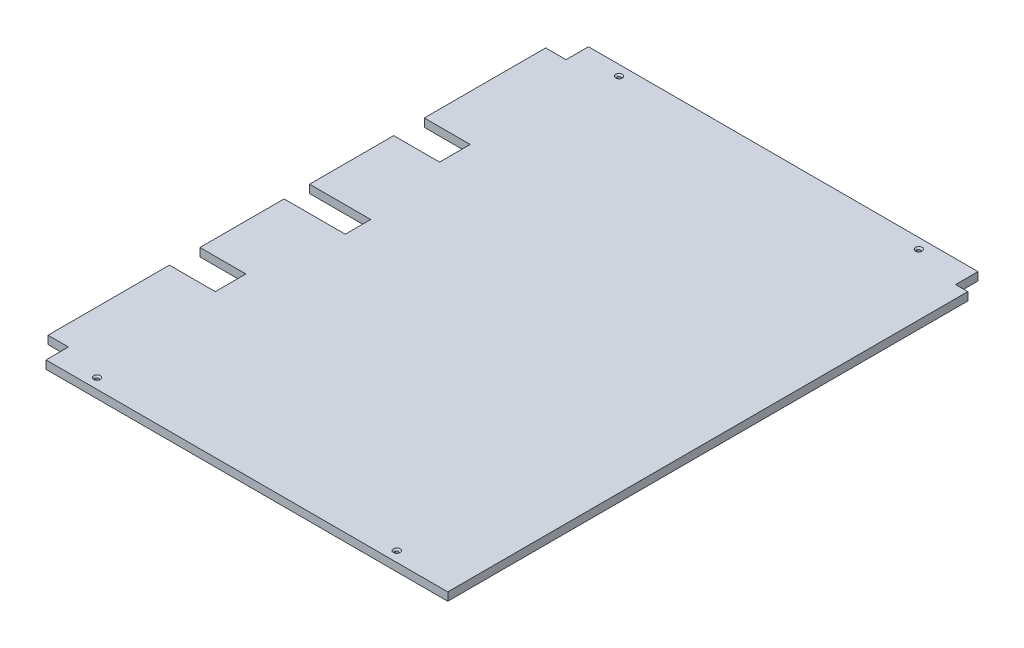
ISO-10303-21;
HEADER;
FILE_DESCRIPTION(('STEP AP214'),'2;1');
FILE_NAME('part.step','',(''),(''),'','','');
FILE_SCHEMA(('AUTOMOTIVE_DESIGN { 1 0 10303 214 1 1 1 1 }'));
ENDSEC;
DATA;
#1=APPLICATION_CONTEXT('core data for automotive mechanical design processes');
#2=APPLICATION_PROTOCOL_DEFINITION('international standard','automotive_design',2000,#1);
#3=PRODUCT_CONTEXT('',#1,'mechanical');
#4=PRODUCT('Part','Part','',(#3));
#5=PRODUCT_RELATED_PRODUCT_CATEGORY('part','',(#4));
#6=PRODUCT_DEFINITION_FORMATION('','',#4);
#7=PRODUCT_DEFINITION_CONTEXT('part definition',#1,'design');
#8=PRODUCT_DEFINITION('design','',#6,#7);
#9=PRODUCT_DEFINITION_SHAPE('','',#8);
#10=(LENGTH_UNIT() NAMED_UNIT(*) SI_UNIT(.MILLI.,.METRE.));
#11=(NAMED_UNIT(*) PLANE_ANGLE_UNIT() SI_UNIT($,.RADIAN.));
#12=(NAMED_UNIT(*) SI_UNIT($,.STERADIAN.) SOLID_ANGLE_UNIT());
#13=UNCERTAINTY_MEASURE_WITH_UNIT(LENGTH_MEASURE(1.E-05),#10,'distance_accuracy_value','');
#14=(GEOMETRIC_REPRESENTATION_CONTEXT(3) GLOBAL_UNCERTAINTY_ASSIGNED_CONTEXT((#13)) GLOBAL_UNIT_ASSIGNED_CONTEXT((#10,
#11,#12)) REPRESENTATION_CONTEXT('',''));
#15=CARTESIAN_POINT('',(0.,0.,0.));
#16=DIRECTION('',(0.,0.,1.));
#17=DIRECTION('',(1.,0.,0.));
#18=AXIS2_PLACEMENT_3D('',#15,#16,#17);
#19=CARTESIAN_POINT('',(-207.,8.,266.));
#20=DIRECTION('',(1.,0.,0.));
#21=DIRECTION('',(0.,0.,-1.));
#22=AXIS2_PLACEMENT_3D('',#19,#20,#21);
#23=PLANE('',#22);
#24=DIRECTION('',(0.,0.,1.));
#25=VECTOR('',#24,1.);
#26=CARTESIAN_POINT('',(-207.,0.,266.));
#27=LINE('',#26,#25);
#28=CARTESIAN_POINT('',(-207.,0.,-244.));
#29=VERTEX_POINT('',#28);
#30=CARTESIAN_POINT('',(-207.,0.,-125.));
#31=VERTEX_POINT('',#30);
#32=EDGE_CURVE('E220',#29,#31,#27,.T.);
#33=ORIENTED_EDGE('',*,*,#32,.T.);
#34=DIRECTION('',(0.,1.,0.));
#35=VECTOR('',#34,1.);
#36=CARTESIAN_POINT('',(-207.,0.,-125.));
#37=LINE('',#36,#35);
#38=CARTESIAN_POINT('',(-207.,8.,-125.));
#39=VERTEX_POINT('',#38);
#40=EDGE_CURVE('E371',#31,#39,#37,.T.);
#41=ORIENTED_EDGE('',*,*,#40,.T.);
#42=DIRECTION('',(0.,0.,1.));
#43=VECTOR('',#42,1.);
#44=CARTESIAN_POINT('',(-207.,8.,266.));
#45=LINE('',#44,#43);
#46=CARTESIAN_POINT('',(-207.,8.,-244.));
#47=VERTEX_POINT('',#46);
#48=EDGE_CURVE('E332',#47,#39,#45,.T.);
#49=ORIENTED_EDGE('',*,*,#48,.F.);
#50=DIRECTION('',(0.,1.,0.));
#51=VECTOR('',#50,1.);
#52=CARTESIAN_POINT('',(-207.,0.,-244.));
#53=LINE('',#52,#51);
#54=EDGE_CURVE('E475',#29,#47,#53,.T.);
#55=ORIENTED_EDGE('',*,*,#54,.F.);
#56=EDGE_LOOP('',(#33,#41,#49,#55));
#57=FACE_BOUND('',#56,.T.);
#58=ADVANCED_FACE('F40',(#57),#23,.F.);
#59=CARTESIAN_POINT('',(-207.,0.,12.5));
#60=VERTEX_POINT('',#59);
#61=CARTESIAN_POINT('',(-207.,0.,95.));
#62=VERTEX_POINT('',#61);
#63=EDGE_CURVE('E221',#60,#62,#27,.T.);
#64=ORIENTED_EDGE('',*,*,#63,.T.);
#65=DIRECTION('',(0.,1.,0.));
#66=VECTOR('',#65,1.);
#67=CARTESIAN_POINT('',(-207.,0.,95.));
#68=LINE('',#67,#66);
#69=CARTESIAN_POINT('',(-207.,8.,95.));
#70=VERTEX_POINT('',#69);
#71=EDGE_CURVE('E357',#62,#70,#68,.T.);
#72=ORIENTED_EDGE('',*,*,#71,.T.);
#73=CARTESIAN_POINT('',(-207.,8.,12.5));
#74=VERTEX_POINT('',#73);
#75=EDGE_CURVE('E329',#74,#70,#45,.T.);
#76=ORIENTED_EDGE('',*,*,#75,.F.);
#77=DIRECTION('',(0.,1.,0.));
#78=VECTOR('',#77,1.);
#79=CARTESIAN_POINT('',(-207.,0.,12.5));
#80=LINE('',#79,#78);
#81=EDGE_CURVE('E433',#60,#74,#80,.T.);
#82=ORIENTED_EDGE('',*,*,#81,.F.);
#83=EDGE_LOOP('',(#64,#72,#76,#82));
#84=FACE_BOUND('',#83,.T.);
#85=ADVANCED_FACE('F288',(#84),#23,.F.);
#86=CARTESIAN_POINT('',(-207.,8.,125.));
#87=VERTEX_POINT('',#86);
#88=CARTESIAN_POINT('',(-207.,8.,244.));
#89=VERTEX_POINT('',#88);
#90=EDGE_CURVE('E319',#87,#89,#45,.T.);
#91=ORIENTED_EDGE('',*,*,#90,.F.);
#92=DIRECTION('',(0.,1.,0.));
#93=VECTOR('',#92,1.);
#94=CARTESIAN_POINT('',(-207.,0.,125.));
#95=LINE('',#94,#93);
#96=CARTESIAN_POINT('',(-207.,0.,125.));
#97=VERTEX_POINT('',#96);
#98=EDGE_CURVE('E320',#97,#87,#95,.T.);
#99=ORIENTED_EDGE('',*,*,#98,.F.);
#100=CARTESIAN_POINT('',(-207.,0.,244.));
#101=VERTEX_POINT('',#100);
#102=EDGE_CURVE('E228',#97,#101,#27,.T.);
#103=ORIENTED_EDGE('',*,*,#102,.T.);
#104=DIRECTION('',(0.,1.,0.));
#105=VECTOR('',#104,1.);
#106=CARTESIAN_POINT('',(-207.,0.,244.));
#107=LINE('',#106,#105);
#108=EDGE_CURVE('E323',#101,#89,#107,.T.);
#109=ORIENTED_EDGE('',*,*,#108,.T.);
#110=EDGE_LOOP('',(#91,#99,#103,#109));
#111=FACE_BOUND('',#110,.T.);
#112=ADVANCED_FACE('F294',(#111),#23,.F.);
#113=CARTESIAN_POINT('',(207.,8.,266.));
#114=DIRECTION('',(-1.,0.,0.));
#115=DIRECTION('',(0.,0.,1.));
#116=AXIS2_PLACEMENT_3D('',#113,#114,#115);
#117=PLANE('',#116);
#118=DIRECTION('',(0.,0.,-1.));
#119=VECTOR('',#118,1.);
#120=CARTESIAN_POINT('',(207.,0.,266.));
#121=LINE('',#120,#119);
#122=CARTESIAN_POINT('',(207.,0.,266.));
#123=VERTEX_POINT('',#122);
#124=CARTESIAN_POINT('',(207.,0.,-244.));
#125=VERTEX_POINT('',#124);
#126=EDGE_CURVE('E460',#123,#125,#121,.T.);
#127=ORIENTED_EDGE('',*,*,#126,.T.);
#128=DIRECTION('',(0.,1.,0.));
#129=VECTOR('',#128,1.);
#130=CARTESIAN_POINT('',(207.,0.,-244.));
#131=LINE('',#130,#129);
#132=CARTESIAN_POINT('',(207.,8.,-244.));
#133=VERTEX_POINT('',#132);
#134=EDGE_CURVE('E480',#125,#133,#131,.T.);
#135=ORIENTED_EDGE('',*,*,#134,.T.);
#136=DIRECTION('',(0.,0.,-1.));
#137=VECTOR('',#136,1.);
#138=CARTESIAN_POINT('',(207.,8.,266.));
#139=LINE('',#138,#137);
#140=CARTESIAN_POINT('',(207.,8.,266.));
#141=VERTEX_POINT('',#140);
#142=EDGE_CURVE('E236',#141,#133,#139,.T.);
#143=ORIENTED_EDGE('',*,*,#142,.F.);
#144=DIRECTION('',(0.,-1.,0.));
#145=VECTOR('',#144,1.);
#146=CARTESIAN_POINT('',(207.,8.,266.));
#147=LINE('',#146,#145);
#148=EDGE_CURVE('E237',#141,#123,#147,.T.);
#149=ORIENTED_EDGE('',*,*,#148,.T.);
#150=EDGE_LOOP('',(#127,#135,#143,#149));
#151=FACE_BOUND('',#150,.T.);
#152=ADVANCED_FACE('F307',(#151),#117,.F.);
#153=CARTESIAN_POINT('',(-207.,8.,-266.));
#154=DIRECTION('',(0.,0.,1.));
#155=DIRECTION('',(1.,0.,0.));
#156=AXIS2_PLACEMENT_3D('',#153,#154,#155);
#157=PLANE('',#156);
#158=DIRECTION('',(-1.,0.,0.));
#159=VECTOR('',#158,1.);
#160=CARTESIAN_POINT('',(-207.,0.,-266.));
#161=LINE('',#160,#159);
#162=CARTESIAN_POINT('',(195.,0.,-266.));
#163=VERTEX_POINT('',#162);
#164=CARTESIAN_POINT('',(-187.,0.,-266.));
#165=VERTEX_POINT('',#164);
#166=EDGE_CURVE('E232',#163,#165,#161,.T.);
#167=ORIENTED_EDGE('',*,*,#166,.T.);
#168=DIRECTION('',(0.,1.,0.));
#169=VECTOR('',#168,1.);
#170=CARTESIAN_POINT('',(-187.,0.,-266.));
#171=LINE('',#170,#169);
#172=CARTESIAN_POINT('',(-187.,8.,-266.));
#173=VERTEX_POINT('',#172);
#174=EDGE_CURVE('E455',#165,#173,#171,.T.);
#175=ORIENTED_EDGE('',*,*,#174,.T.);
#176=DIRECTION('',(-1.,0.,0.));
#177=VECTOR('',#176,1.);
#178=CARTESIAN_POINT('',(-207.,8.,-266.));
#179=LINE('',#178,#177);
#180=CARTESIAN_POINT('',(195.,8.,-266.));
#181=VERTEX_POINT('',#180);
#182=EDGE_CURVE('E330',#181,#173,#179,.T.);
#183=ORIENTED_EDGE('',*,*,#182,.F.);
#184=DIRECTION('',(0.,1.,0.));
#185=VECTOR('',#184,1.);
#186=CARTESIAN_POINT('',(195.,0.,-266.));
#187=LINE('',#186,#185);
#188=EDGE_CURVE('E500',#163,#181,#187,.T.);
#189=ORIENTED_EDGE('',*,*,#188,.F.);
#190=EDGE_LOOP('',(#167,#175,#183,#189));
#191=FACE_BOUND('',#190,.T.);
#192=ADVANCED_FACE('F300',(#191),#157,.F.);
#193=CARTESIAN_POINT('',(-207.,8.,-95.));
#194=VERTEX_POINT('',#193);
#195=CARTESIAN_POINT('',(-207.,8.,-12.5));
#196=VERTEX_POINT('',#195);
#197=EDGE_CURVE('E209',#194,#196,#45,.T.);
#198=ORIENTED_EDGE('',*,*,#197,.F.);
#199=DIRECTION('',(0.,1.,0.));
#200=VECTOR('',#199,1.);
#201=CARTESIAN_POINT('',(-207.,0.,-95.));
#202=LINE('',#201,#200);
#203=CARTESIAN_POINT('',(-207.,0.,-95.));
#204=VERTEX_POINT('',#203);
#205=EDGE_CURVE('E194',#204,#194,#202,.T.);
#206=ORIENTED_EDGE('',*,*,#205,.F.);
#207=CARTESIAN_POINT('',(-207.,0.,-12.5));
#208=VERTEX_POINT('',#207);
#209=EDGE_CURVE('E207',#204,#208,#27,.T.);
#210=ORIENTED_EDGE('',*,*,#209,.T.);
#211=DIRECTION('',(0.,1.,0.));
#212=VECTOR('',#211,1.);
#213=CARTESIAN_POINT('',(-207.,0.,-12.5));
#214=LINE('',#213,#212);
#215=EDGE_CURVE('E436',#208,#196,#214,.T.);
#216=ORIENTED_EDGE('',*,*,#215,.T.);
#217=EDGE_LOOP('',(#198,#206,#210,#216));
#218=FACE_BOUND('',#217,.T.);
#219=ADVANCED_FACE('F205',(#218),#23,.F.);
#220=CARTESIAN_POINT('',(-207.,8.,266.));
#221=DIRECTION('',(0.,0.,-1.));
#222=DIRECTION('',(-1.,0.,0.));
#223=AXIS2_PLACEMENT_3D('',#220,#221,#222);
#224=PLANE('',#223);
#225=DIRECTION('',(1.,0.,0.));
#226=VECTOR('',#225,1.);
#227=CARTESIAN_POINT('',(-207.,8.,266.));
#228=LINE('',#227,#226);
#229=CARTESIAN_POINT('',(-187.,8.,266.));
#230=VERTEX_POINT('',#229);
#231=EDGE_CURVE('E242',#230,#141,#228,.T.);
#232=ORIENTED_EDGE('',*,*,#231,.F.);
#233=DIRECTION('',(0.,1.,0.));
#234=VECTOR('',#233,1.);
#235=CARTESIAN_POINT('',(-187.,0.,266.));
#236=LINE('',#235,#234);
#237=CARTESIAN_POINT('',(-187.,0.,266.));
#238=VERTEX_POINT('',#237);
#239=EDGE_CURVE('E450',#238,#230,#236,.T.);
#240=ORIENTED_EDGE('',*,*,#239,.F.);
#241=DIRECTION('',(1.,0.,0.));
#242=VECTOR('',#241,1.);
#243=CARTESIAN_POINT('',(-207.,0.,266.));
#244=LINE('',#243,#242);
#245=EDGE_CURVE('E227',#238,#123,#244,.T.);
#246=ORIENTED_EDGE('',*,*,#245,.T.);
#247=ORIENTED_EDGE('',*,*,#148,.F.);
#248=EDGE_LOOP('',(#232,#240,#246,#247));
#249=FACE_BOUND('',#248,.T.);
#250=ADVANCED_FACE('F299',(#249),#224,.F.);
#251=CARTESIAN_POINT('',(0.,8.,0.));
#252=DIRECTION('',(0.,-1.,0.));
#253=DIRECTION('',(0.,0.,-1.));
#254=AXIS2_PLACEMENT_3D('',#251,#252,#253);
#255=PLANE('',#254);
#256=CARTESIAN_POINT('',(147.,8.,-256.));
#257=DIRECTION('',(0.,-1.,0.));
#258=DIRECTION('',(0.,0.,-1.));
#259=AXIS2_PLACEMENT_3D('',#256,#257,#258);
#260=CIRCLE('',#259,3.25000000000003);
#261=CARTESIAN_POINT('',(147.,8.,-259.25));
#262=VERTEX_POINT('',#261);
#263=EDGE_CURVE('E258',#262,#262,#260,.T.);
#264=ORIENTED_EDGE('',*,*,#263,.T.);
#265=EDGE_LOOP('',(#264));
#266=FACE_BOUND('',#265,.T.);
#267=CARTESIAN_POINT('',(-147.,8.,-256.));
#268=DIRECTION('',(0.,-1.,0.));
#269=DIRECTION('',(0.,0.,-1.));
#270=AXIS2_PLACEMENT_3D('',#267,#268,#269);
#271=CIRCLE('',#270,3.25000000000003);
#272=CARTESIAN_POINT('',(-147.,8.,-259.25));
#273=VERTEX_POINT('',#272);
#274=EDGE_CURVE('E254',#273,#273,#271,.T.);
#275=ORIENTED_EDGE('',*,*,#274,.T.);
#276=EDGE_LOOP('',(#275));
#277=FACE_BOUND('',#276,.T.);
#278=CARTESIAN_POINT('',(-147.,8.,256.));
#279=DIRECTION('',(0.,-1.,0.));
#280=DIRECTION('',(0.,0.,-1.));
#281=AXIS2_PLACEMENT_3D('',#278,#279,#280);
#282=CIRCLE('',#281,3.24999999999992);
#283=CARTESIAN_POINT('',(-147.,8.,252.75));
#284=VERTEX_POINT('',#283);
#285=EDGE_CURVE('E250',#284,#284,#282,.T.);
#286=ORIENTED_EDGE('',*,*,#285,.T.);
#287=EDGE_LOOP('',(#286));
#288=FACE_BOUND('',#287,.T.);
#289=CARTESIAN_POINT('',(147.,8.,256.));
#290=DIRECTION('',(0.,-1.,0.));
#291=DIRECTION('',(0.,0.,-1.));
#292=AXIS2_PLACEMENT_3D('',#289,#290,#291);
#293=CIRCLE('',#292,3.25000000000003);
#294=CARTESIAN_POINT('',(147.,8.,252.75));
#295=VERTEX_POINT('',#294);
#296=EDGE_CURVE('E246',#295,#295,#293,.T.);
#297=ORIENTED_EDGE('',*,*,#296,.T.);
#298=EDGE_LOOP('',(#297));
#299=FACE_BOUND('',#298,.T.);
#300=ORIENTED_EDGE('',*,*,#48,.T.);
#301=DIRECTION('',(-1.,0.,0.));
#302=VECTOR('',#301,1.);
#303=CARTESIAN_POINT('',(-207.,8.,-125.));
#304=LINE('',#303,#302);
#305=CARTESIAN_POINT('',(-162.,8.,-125.));
#306=VERTEX_POINT('',#305);
#307=EDGE_CURVE('E200',#306,#39,#304,.T.);
#308=ORIENTED_EDGE('',*,*,#307,.F.);
#309=DIRECTION('',(0.,0.,-1.));
#310=VECTOR('',#309,1.);
#311=CARTESIAN_POINT('',(-162.,8.,-125.));
#312=LINE('',#311,#310);
#313=CARTESIAN_POINT('',(-162.,8.,-95.));
#314=VERTEX_POINT('',#313);
#315=EDGE_CURVE('E355',#314,#306,#312,.T.);
#316=ORIENTED_EDGE('',*,*,#315,.F.);
#317=DIRECTION('',(1.,0.,0.));
#318=VECTOR('',#317,1.);
#319=CARTESIAN_POINT('',(-207.,8.,-95.));
#320=LINE('',#319,#318);
#321=EDGE_CURVE('E353',#194,#314,#320,.T.);
#322=ORIENTED_EDGE('',*,*,#321,.F.);
#323=ORIENTED_EDGE('',*,*,#197,.T.);
#324=DIRECTION('',(-1.,0.,0.));
#325=VECTOR('',#324,1.);
#326=CARTESIAN_POINT('',(-147.,8.,-12.5));
#327=LINE('',#326,#325);
#328=CARTESIAN_POINT('',(-147.,8.,-12.5));
#329=VERTEX_POINT('',#328);
#330=EDGE_CURVE('E351',#329,#196,#327,.T.);
#331=ORIENTED_EDGE('',*,*,#330,.F.);
#332=DIRECTION('',(0.,0.,-1.));
#333=VECTOR('',#332,1.);
#334=CARTESIAN_POINT('',(-147.,8.,-12.5));
#335=LINE('',#334,#333);
#336=CARTESIAN_POINT('',(-147.,8.,12.5));
#337=VERTEX_POINT('',#336);
#338=EDGE_CURVE('E421',#337,#329,#335,.T.);
#339=ORIENTED_EDGE('',*,*,#338,.F.);
#340=DIRECTION('',(1.,0.,0.));
#341=VECTOR('',#340,1.);
#342=CARTESIAN_POINT('',(-147.,8.,12.5));
#343=LINE('',#342,#341);
#344=EDGE_CURVE('E413',#74,#337,#343,.T.);
#345=ORIENTED_EDGE('',*,*,#344,.F.);
#346=ORIENTED_EDGE('',*,*,#75,.T.);
#347=DIRECTION('',(-1.,0.,0.));
#348=VECTOR('',#347,1.);
#349=CARTESIAN_POINT('',(-207.,8.,95.));
#350=LINE('',#349,#348);
#351=CARTESIAN_POINT('',(-162.,8.,95.));
#352=VERTEX_POINT('',#351);
#353=EDGE_CURVE('E385',#352,#70,#350,.T.);
#354=ORIENTED_EDGE('',*,*,#353,.F.);
#355=DIRECTION('',(0.,0.,-1.));
#356=VECTOR('',#355,1.);
#357=CARTESIAN_POINT('',(-162.,8.,95.));
#358=LINE('',#357,#356);
#359=CARTESIAN_POINT('',(-162.,8.,125.));
#360=VERTEX_POINT('',#359);
#361=EDGE_CURVE('E396',#360,#352,#358,.T.);
#362=ORIENTED_EDGE('',*,*,#361,.F.);
#363=DIRECTION('',(1.,0.,0.));
#364=VECTOR('',#363,1.);
#365=CARTESIAN_POINT('',(-207.,8.,125.));
#366=LINE('',#365,#364);
#367=EDGE_CURVE('E392',#87,#360,#366,.T.);
#368=ORIENTED_EDGE('',*,*,#367,.F.);
#369=ORIENTED_EDGE('',*,*,#90,.T.);
#370=DIRECTION('',(-1.,0.,0.));
#371=VECTOR('',#370,1.);
#372=CARTESIAN_POINT('',(-207.,8.,244.));
#373=LINE('',#372,#371);
#374=CARTESIAN_POINT('',(-187.,8.,244.));
#375=VERTEX_POINT('',#374);
#376=EDGE_CURVE('E446',#375,#89,#373,.T.);
#377=ORIENTED_EDGE('',*,*,#376,.F.);
#378=DIRECTION('',(0.,0.,-1.));
#379=VECTOR('',#378,1.);
#380=CARTESIAN_POINT('',(-187.,8.,266.));
#381=LINE('',#380,#379);
#382=EDGE_CURVE('E451',#230,#375,#381,.T.);
#383=ORIENTED_EDGE('',*,*,#382,.F.);
#384=ORIENTED_EDGE('',*,*,#231,.T.);
#385=ORIENTED_EDGE('',*,*,#142,.T.);
#386=DIRECTION('',(1.,0.,0.));
#387=VECTOR('',#386,1.);
#388=CARTESIAN_POINT('',(207.,8.,-244.));
#389=LINE('',#388,#387);
#390=CARTESIAN_POINT('',(195.,8.,-244.));
#391=VERTEX_POINT('',#390);
#392=EDGE_CURVE('E496',#391,#133,#389,.T.);
#393=ORIENTED_EDGE('',*,*,#392,.F.);
#394=DIRECTION('',(0.,0.,1.));
#395=VECTOR('',#394,1.);
#396=CARTESIAN_POINT('',(195.,8.,-266.));
#397=LINE('',#396,#395);
#398=EDGE_CURVE('E375',#181,#391,#397,.T.);
#399=ORIENTED_EDGE('',*,*,#398,.F.);
#400=ORIENTED_EDGE('',*,*,#182,.T.);
#401=DIRECTION('',(0.,0.,-1.));
#402=VECTOR('',#401,1.);
#403=CARTESIAN_POINT('',(-187.,8.,-266.));
#404=LINE('',#403,#402);
#405=CARTESIAN_POINT('',(-187.,8.,-244.));
#406=VERTEX_POINT('',#405);
#407=EDGE_CURVE('E471',#406,#173,#404,.T.);
#408=ORIENTED_EDGE('',*,*,#407,.F.);
#409=DIRECTION('',(1.,0.,0.));
#410=VECTOR('',#409,1.);
#411=CARTESIAN_POINT('',(-207.,8.,-244.));
#412=LINE('',#411,#410);
#413=EDGE_CURVE('E476',#47,#406,#412,.T.);
#414=ORIENTED_EDGE('',*,*,#413,.F.);
#415=EDGE_LOOP('',(#300,#308,#316,#322,#323,#331,#339,#345,#346,#354,#362,#368,#369,#377,#383,
#384,#385,#393,#399,#400,#408,#414));
#416=FACE_BOUND('',#415,.T.);
#417=ADVANCED_FACE('F305',(#266,#277,#288,#299,#416),#255,.F.);
#418=CARTESIAN_POINT('',(0.,0.,0.));
#419=DIRECTION('',(0.,-1.,0.));
#420=DIRECTION('',(0.,0.,-1.));
#421=AXIS2_PLACEMENT_3D('',#418,#419,#420);
#422=PLANE('',#421);
#423=CARTESIAN_POINT('',(-147.,0.,256.));
#424=DIRECTION('',(0.,1.,0.));
#425=DIRECTION('',(0.,0.,1.));
#426=AXIS2_PLACEMENT_3D('',#423,#424,#425);
#427=CIRCLE('',#426,1.75);
#428=CARTESIAN_POINT('',(-147.,0.,257.75));
#429=VERTEX_POINT('',#428);
#430=EDGE_CURVE('E561',#429,#429,#427,.T.);
#431=ORIENTED_EDGE('',*,*,#430,.T.);
#432=EDGE_LOOP('',(#431));
#433=FACE_BOUND('',#432,.T.);
#434=CARTESIAN_POINT('',(147.,0.,256.));
#435=DIRECTION('',(0.,1.,0.));
#436=DIRECTION('',(0.,0.,1.));
#437=AXIS2_PLACEMENT_3D('',#434,#435,#436);
#438=CIRCLE('',#437,1.75);
#439=CARTESIAN_POINT('',(147.,0.,257.75));
#440=VERTEX_POINT('',#439);
#441=EDGE_CURVE('E557',#440,#440,#438,.T.);
#442=ORIENTED_EDGE('',*,*,#441,.T.);
#443=EDGE_LOOP('',(#442));
#444=FACE_BOUND('',#443,.T.);
#445=CARTESIAN_POINT('',(147.,0.,-256.));
#446=DIRECTION('',(0.,1.,0.));
#447=DIRECTION('',(0.,0.,1.));
#448=AXIS2_PLACEMENT_3D('',#445,#446,#447);
#449=CIRCLE('',#448,1.75);
#450=CARTESIAN_POINT('',(147.,0.,-254.25));
#451=VERTEX_POINT('',#450);
#452=EDGE_CURVE('E553',#451,#451,#449,.T.);
#453=ORIENTED_EDGE('',*,*,#452,.T.);
#454=EDGE_LOOP('',(#453));
#455=FACE_BOUND('',#454,.T.);
#456=CARTESIAN_POINT('',(-147.,0.,-256.));
#457=DIRECTION('',(0.,1.,0.));
#458=DIRECTION('',(0.,0.,1.));
#459=AXIS2_PLACEMENT_3D('',#456,#457,#458);
#460=CIRCLE('',#459,1.75);
#461=CARTESIAN_POINT('',(-147.,0.,-254.25));
#462=VERTEX_POINT('',#461);
#463=EDGE_CURVE('E425',#462,#462,#460,.T.);
#464=ORIENTED_EDGE('',*,*,#463,.T.);
#465=EDGE_LOOP('',(#464));
#466=FACE_BOUND('',#465,.T.);
#467=DIRECTION('',(-1.,0.,0.));
#468=VECTOR('',#467,1.);
#469=CARTESIAN_POINT('',(-207.,0.,-125.));
#470=LINE('',#469,#468);
#471=CARTESIAN_POINT('',(-162.,0.,-125.));
#472=VERTEX_POINT('',#471);
#473=EDGE_CURVE('E211',#472,#31,#470,.T.);
#474=ORIENTED_EDGE('',*,*,#473,.T.);
#475=ORIENTED_EDGE('',*,*,#32,.F.);
#476=DIRECTION('',(1.,0.,0.));
#477=VECTOR('',#476,1.);
#478=CARTESIAN_POINT('',(-207.,0.,-244.));
#479=LINE('',#478,#477);
#480=CARTESIAN_POINT('',(-187.,0.,-244.));
#481=VERTEX_POINT('',#480);
#482=EDGE_CURVE('E466',#29,#481,#479,.T.);
#483=ORIENTED_EDGE('',*,*,#482,.T.);
#484=DIRECTION('',(0.,0.,-1.));
#485=VECTOR('',#484,1.);
#486=CARTESIAN_POINT('',(-187.,0.,-266.));
#487=LINE('',#486,#485);
#488=EDGE_CURVE('E470',#481,#165,#487,.T.);
#489=ORIENTED_EDGE('',*,*,#488,.T.);
#490=ORIENTED_EDGE('',*,*,#166,.F.);
#491=DIRECTION('',(0.,0.,1.));
#492=VECTOR('',#491,1.);
#493=CARTESIAN_POINT('',(195.,0.,-266.));
#494=LINE('',#493,#492);
#495=CARTESIAN_POINT('',(195.,0.,-244.));
#496=VERTEX_POINT('',#495);
#497=EDGE_CURVE('E491',#163,#496,#494,.T.);
#498=ORIENTED_EDGE('',*,*,#497,.T.);
#499=DIRECTION('',(1.,0.,0.));
#500=VECTOR('',#499,1.);
#501=CARTESIAN_POINT('',(207.,0.,-244.));
#502=LINE('',#501,#500);
#503=EDGE_CURVE('E495',#496,#125,#502,.T.);
#504=ORIENTED_EDGE('',*,*,#503,.T.);
#505=ORIENTED_EDGE('',*,*,#126,.F.);
#506=ORIENTED_EDGE('',*,*,#245,.F.);
#507=DIRECTION('',(0.,0.,-1.));
#508=VECTOR('',#507,1.);
#509=CARTESIAN_POINT('',(-187.,0.,266.));
#510=LINE('',#509,#508);
#511=CARTESIAN_POINT('',(-187.,0.,244.));
#512=VERTEX_POINT('',#511);
#513=EDGE_CURVE('E441',#238,#512,#510,.T.);
#514=ORIENTED_EDGE('',*,*,#513,.T.);
#515=DIRECTION('',(-1.,0.,0.));
#516=VECTOR('',#515,1.);
#517=CARTESIAN_POINT('',(-207.,0.,244.));
#518=LINE('',#517,#516);
#519=EDGE_CURVE('E445',#512,#101,#518,.T.);
#520=ORIENTED_EDGE('',*,*,#519,.T.);
#521=ORIENTED_EDGE('',*,*,#102,.F.);
#522=DIRECTION('',(1.,0.,0.));
#523=VECTOR('',#522,1.);
#524=CARTESIAN_POINT('',(-207.,0.,125.));
#525=LINE('',#524,#523);
#526=CARTESIAN_POINT('',(-162.,0.,125.));
#527=VERTEX_POINT('',#526);
#528=EDGE_CURVE('E381',#97,#527,#525,.T.);
#529=ORIENTED_EDGE('',*,*,#528,.T.);
#530=DIRECTION('',(0.,0.,-1.));
#531=VECTOR('',#530,1.);
#532=CARTESIAN_POINT('',(-162.,0.,95.));
#533=LINE('',#532,#531);
#534=CARTESIAN_POINT('',(-162.,0.,95.));
#535=VERTEX_POINT('',#534);
#536=EDGE_CURVE('E65',#527,#535,#533,.T.);
#537=ORIENTED_EDGE('',*,*,#536,.T.);
#538=DIRECTION('',(-1.,0.,0.));
#539=VECTOR('',#538,1.);
#540=CARTESIAN_POINT('',(-207.,0.,95.));
#541=LINE('',#540,#539);
#542=EDGE_CURVE('E388',#535,#62,#541,.T.);
#543=ORIENTED_EDGE('',*,*,#542,.T.);
#544=ORIENTED_EDGE('',*,*,#63,.F.);
#545=DIRECTION('',(1.,0.,0.));
#546=VECTOR('',#545,1.);
#547=CARTESIAN_POINT('',(-147.,0.,12.5));
#548=LINE('',#547,#546);
#549=CARTESIAN_POINT('',(-147.,0.,12.5));
#550=VERTEX_POINT('',#549);
#551=EDGE_CURVE('E416',#60,#550,#548,.T.);
#552=ORIENTED_EDGE('',*,*,#551,.T.);
#553=DIRECTION('',(0.,0.,-1.));
#554=VECTOR('',#553,1.);
#555=CARTESIAN_POINT('',(-147.,0.,-12.5));
#556=LINE('',#555,#554);
#557=CARTESIAN_POINT('',(-147.,0.,-12.5));
#558=VERTEX_POINT('',#557);
#559=EDGE_CURVE('E410',#550,#558,#556,.T.);
#560=ORIENTED_EDGE('',*,*,#559,.T.);
#561=DIRECTION('',(-1.,0.,0.));
#562=VECTOR('',#561,1.);
#563=CARTESIAN_POINT('',(-147.,0.,-12.5));
#564=LINE('',#563,#562);
#565=EDGE_CURVE('E218',#558,#208,#564,.T.);
#566=ORIENTED_EDGE('',*,*,#565,.T.);
#567=ORIENTED_EDGE('',*,*,#209,.F.);
#568=DIRECTION('',(1.,0.,0.));
#569=VECTOR('',#568,1.);
#570=CARTESIAN_POINT('',(-207.,0.,-95.));
#571=LINE('',#570,#569);
#572=CARTESIAN_POINT('',(-162.,0.,-95.));
#573=VERTEX_POINT('',#572);
#574=EDGE_CURVE('E190',#204,#573,#571,.T.);
#575=ORIENTED_EDGE('',*,*,#574,.T.);
#576=DIRECTION('',(0.,0.,-1.));
#577=VECTOR('',#576,1.);
#578=CARTESIAN_POINT('',(-162.,0.,-125.));
#579=LINE('',#578,#577);
#580=EDGE_CURVE('E57',#573,#472,#579,.T.);
#581=ORIENTED_EDGE('',*,*,#580,.T.);
#582=EDGE_LOOP('',(#474,#475,#483,#489,#490,#498,#504,#505,#506,#514,#520,#521,#529,#537,#543,
#544,#552,#560,#566,#567,#575,#581));
#583=FACE_BOUND('',#582,.T.);
#584=ADVANCED_FACE('F215',(#433,#444,#455,#466,#583),#422,.T.);
#585=CARTESIAN_POINT('',(207.,0.,-244.));
#586=DIRECTION('',(0.,0.,1.));
#587=DIRECTION('',(1.,0.,0.));
#588=AXIS2_PLACEMENT_3D('',#585,#586,#587);
#589=PLANE('',#588);
#590=ORIENTED_EDGE('',*,*,#392,.T.);
#591=ORIENTED_EDGE('',*,*,#134,.F.);
#592=ORIENTED_EDGE('',*,*,#503,.F.);
#593=DIRECTION('',(0.,1.,0.));
#594=VECTOR('',#593,1.);
#595=CARTESIAN_POINT('',(195.,0.,-244.));
#596=LINE('',#595,#594);
#597=EDGE_CURVE('E509',#496,#391,#596,.T.);
#598=ORIENTED_EDGE('',*,*,#597,.T.);
#599=EDGE_LOOP('',(#590,#591,#592,#598));
#600=FACE_BOUND('',#599,.T.);
#601=ADVANCED_FACE('F526',(#600),#589,.F.);
#602=CARTESIAN_POINT('',(195.,0.,-266.));
#603=DIRECTION('',(-1.,0.,0.));
#604=DIRECTION('',(0.,0.,1.));
#605=AXIS2_PLACEMENT_3D('',#602,#603,#604);
#606=PLANE('',#605);
#607=ORIENTED_EDGE('',*,*,#398,.T.);
#608=ORIENTED_EDGE('',*,*,#597,.F.);
#609=ORIENTED_EDGE('',*,*,#497,.F.);
#610=ORIENTED_EDGE('',*,*,#188,.T.);
#611=EDGE_LOOP('',(#607,#608,#609,#610));
#612=FACE_BOUND('',#611,.T.);
#613=ADVANCED_FACE('F533',(#612),#606,.F.);
#614=CARTESIAN_POINT('',(-187.,0.,-266.));
#615=DIRECTION('',(1.,0.,0.));
#616=DIRECTION('',(0.,0.,-1.));
#617=AXIS2_PLACEMENT_3D('',#614,#615,#616);
#618=PLANE('',#617);
#619=ORIENTED_EDGE('',*,*,#407,.T.);
#620=ORIENTED_EDGE('',*,*,#174,.F.);
#621=ORIENTED_EDGE('',*,*,#488,.F.);
#622=DIRECTION('',(0.,1.,0.));
#623=VECTOR('',#622,1.);
#624=CARTESIAN_POINT('',(-187.,0.,-244.));
#625=LINE('',#624,#623);
#626=EDGE_CURVE('E486',#481,#406,#625,.T.);
#627=ORIENTED_EDGE('',*,*,#626,.T.);
#628=EDGE_LOOP('',(#619,#620,#621,#627));
#629=FACE_BOUND('',#628,.T.);
#630=ADVANCED_FACE('F537',(#629),#618,.F.);
#631=CARTESIAN_POINT('',(-207.,0.,-244.));
#632=DIRECTION('',(0.,0.,1.));
#633=DIRECTION('',(1.,0.,0.));
#634=AXIS2_PLACEMENT_3D('',#631,#632,#633);
#635=PLANE('',#634);
#636=ORIENTED_EDGE('',*,*,#413,.T.);
#637=ORIENTED_EDGE('',*,*,#626,.F.);
#638=ORIENTED_EDGE('',*,*,#482,.F.);
#639=ORIENTED_EDGE('',*,*,#54,.T.);
#640=EDGE_LOOP('',(#636,#637,#638,#639));
#641=FACE_BOUND('',#640,.T.);
#642=ADVANCED_FACE('F540',(#641),#635,.F.);
#643=CARTESIAN_POINT('',(-207.,0.,244.));
#644=DIRECTION('',(0.,0.,-1.));
#645=DIRECTION('',(-1.,0.,0.));
#646=AXIS2_PLACEMENT_3D('',#643,#644,#645);
#647=PLANE('',#646);
#648=ORIENTED_EDGE('',*,*,#376,.T.);
#649=ORIENTED_EDGE('',*,*,#108,.F.);
#650=ORIENTED_EDGE('',*,*,#519,.F.);
#651=DIRECTION('',(0.,1.,0.));
#652=VECTOR('',#651,1.);
#653=CARTESIAN_POINT('',(-187.,0.,244.));
#654=LINE('',#653,#652);
#655=EDGE_CURVE('E461',#512,#375,#654,.T.);
#656=ORIENTED_EDGE('',*,*,#655,.T.);
#657=EDGE_LOOP('',(#648,#649,#650,#656));
#658=FACE_BOUND('',#657,.T.);
#659=ADVANCED_FACE('F620',(#658),#647,.F.);
#660=CARTESIAN_POINT('',(-187.,0.,266.));
#661=DIRECTION('',(1.,0.,0.));
#662=DIRECTION('',(0.,0.,-1.));
#663=AXIS2_PLACEMENT_3D('',#660,#661,#662);
#664=PLANE('',#663);
#665=ORIENTED_EDGE('',*,*,#382,.T.);
#666=ORIENTED_EDGE('',*,*,#655,.F.);
#667=ORIENTED_EDGE('',*,*,#513,.F.);
#668=ORIENTED_EDGE('',*,*,#239,.T.);
#669=EDGE_LOOP('',(#665,#666,#667,#668));
#670=FACE_BOUND('',#669,.T.);
#671=ADVANCED_FACE('F618',(#670),#664,.F.);
#672=CARTESIAN_POINT('',(-147.,0.,-12.5));
#673=DIRECTION('',(1.,0.,0.));
#674=DIRECTION('',(0.,0.,-1.));
#675=AXIS2_PLACEMENT_3D('',#672,#673,#674);
#676=PLANE('',#675);
#677=ORIENTED_EDGE('',*,*,#338,.T.);
#678=DIRECTION('',(0.,1.,0.));
#679=VECTOR('',#678,1.);
#680=CARTESIAN_POINT('',(-147.,0.,-12.5));
#681=LINE('',#680,#679);
#682=EDGE_CURVE('E420',#558,#329,#681,.T.);
#683=ORIENTED_EDGE('',*,*,#682,.F.);
#684=ORIENTED_EDGE('',*,*,#559,.F.);
#685=DIRECTION('',(0.,1.,0.));
#686=VECTOR('',#685,1.);
#687=CARTESIAN_POINT('',(-147.,0.,12.5));
#688=LINE('',#687,#686);
#689=EDGE_CURVE('E397',#550,#337,#688,.T.);
#690=ORIENTED_EDGE('',*,*,#689,.T.);
#691=EDGE_LOOP('',(#677,#683,#684,#690));
#692=FACE_BOUND('',#691,.T.);
#693=ADVANCED_FACE('F611',(#692),#676,.F.);
#694=CARTESIAN_POINT('',(-147.,0.,12.5));
#695=DIRECTION('',(0.,0.,1.));
#696=DIRECTION('',(1.,0.,0.));
#697=AXIS2_PLACEMENT_3D('',#694,#695,#696);
#698=PLANE('',#697);
#699=ORIENTED_EDGE('',*,*,#344,.T.);
#700=ORIENTED_EDGE('',*,*,#689,.F.);
#701=ORIENTED_EDGE('',*,*,#551,.F.);
#702=ORIENTED_EDGE('',*,*,#81,.T.);
#703=EDGE_LOOP('',(#699,#700,#701,#702));
#704=FACE_BOUND('',#703,.T.);
#705=ADVANCED_FACE('F608',(#704),#698,.F.);
#706=CARTESIAN_POINT('',(-147.,0.,-12.5));
#707=DIRECTION('',(0.,0.,-1.));
#708=DIRECTION('',(-1.,0.,0.));
#709=AXIS2_PLACEMENT_3D('',#706,#707,#708);
#710=PLANE('',#709);
#711=ORIENTED_EDGE('',*,*,#330,.T.);
#712=ORIENTED_EDGE('',*,*,#215,.F.);
#713=ORIENTED_EDGE('',*,*,#565,.F.);
#714=ORIENTED_EDGE('',*,*,#682,.T.);
#715=EDGE_LOOP('',(#711,#712,#713,#714));
#716=FACE_BOUND('',#715,.T.);
#717=ADVANCED_FACE('F601',(#716),#710,.F.);
#718=CARTESIAN_POINT('',(-207.,0.,95.));
#719=DIRECTION('',(0.,0.,-1.));
#720=DIRECTION('',(-1.,0.,0.));
#721=AXIS2_PLACEMENT_3D('',#718,#719,#720);
#722=PLANE('',#721);
#723=ORIENTED_EDGE('',*,*,#353,.T.);
#724=ORIENTED_EDGE('',*,*,#71,.F.);
#725=ORIENTED_EDGE('',*,*,#542,.F.);
#726=DIRECTION('',(0.,1.,0.));
#727=VECTOR('',#726,1.);
#728=CARTESIAN_POINT('',(-162.,0.,95.));
#729=LINE('',#728,#727);
#730=EDGE_CURVE('E364',#535,#352,#729,.T.);
#731=ORIENTED_EDGE('',*,*,#730,.T.);
#732=EDGE_LOOP('',(#723,#724,#725,#731));
#733=FACE_BOUND('',#732,.T.);
#734=ADVANCED_FACE('F597',(#733),#722,.F.);
#735=CARTESIAN_POINT('',(-162.,0.,95.));
#736=DIRECTION('',(1.,0.,0.));
#737=DIRECTION('',(0.,0.,-1.));
#738=AXIS2_PLACEMENT_3D('',#735,#736,#737);
#739=PLANE('',#738);
#740=ORIENTED_EDGE('',*,*,#361,.T.);
#741=ORIENTED_EDGE('',*,*,#730,.F.);
#742=ORIENTED_EDGE('',*,*,#536,.F.);
#743=DIRECTION('',(0.,1.,0.));
#744=VECTOR('',#743,1.);
#745=CARTESIAN_POINT('',(-162.,0.,125.));
#746=LINE('',#745,#744);
#747=EDGE_CURVE('E405',#527,#360,#746,.T.);
#748=ORIENTED_EDGE('',*,*,#747,.T.);
#749=EDGE_LOOP('',(#740,#741,#742,#748));
#750=FACE_BOUND('',#749,.T.);
#751=ADVANCED_FACE('F600',(#750),#739,.F.);
#752=CARTESIAN_POINT('',(-207.,0.,125.));
#753=DIRECTION('',(0.,0.,1.));
#754=DIRECTION('',(1.,0.,0.));
#755=AXIS2_PLACEMENT_3D('',#752,#753,#754);
#756=PLANE('',#755);
#757=ORIENTED_EDGE('',*,*,#367,.T.);
#758=ORIENTED_EDGE('',*,*,#747,.F.);
#759=ORIENTED_EDGE('',*,*,#528,.F.);
#760=ORIENTED_EDGE('',*,*,#98,.T.);
#761=EDGE_LOOP('',(#757,#758,#759,#760));
#762=FACE_BOUND('',#761,.T.);
#763=ADVANCED_FACE('F592',(#762),#756,.F.);
#764=CARTESIAN_POINT('',(-207.,0.,-125.));
#765=DIRECTION('',(0.,0.,-1.));
#766=DIRECTION('',(-1.,0.,0.));
#767=AXIS2_PLACEMENT_3D('',#764,#765,#766);
#768=PLANE('',#767);
#769=ORIENTED_EDGE('',*,*,#307,.T.);
#770=ORIENTED_EDGE('',*,*,#40,.F.);
#771=ORIENTED_EDGE('',*,*,#473,.F.);
#772=DIRECTION('',(0.,1.,0.));
#773=VECTOR('',#772,1.);
#774=CARTESIAN_POINT('',(-162.,0.,-125.));
#775=LINE('',#774,#773);
#776=EDGE_CURVE('E376',#472,#306,#775,.T.);
#777=ORIENTED_EDGE('',*,*,#776,.T.);
#778=EDGE_LOOP('',(#769,#770,#771,#777));
#779=FACE_BOUND('',#778,.T.);
#780=ADVANCED_FACE('F588',(#779),#768,.F.);
#781=CARTESIAN_POINT('',(-162.,0.,-125.));
#782=DIRECTION('',(1.,0.,0.));
#783=DIRECTION('',(0.,0.,-1.));
#784=AXIS2_PLACEMENT_3D('',#781,#782,#783);
#785=PLANE('',#784);
#786=ORIENTED_EDGE('',*,*,#315,.T.);
#787=ORIENTED_EDGE('',*,*,#776,.F.);
#788=ORIENTED_EDGE('',*,*,#580,.F.);
#789=DIRECTION('',(0.,1.,0.));
#790=VECTOR('',#789,1.);
#791=CARTESIAN_POINT('',(-162.,0.,-95.));
#792=LINE('',#791,#790);
#793=EDGE_CURVE('E196',#573,#314,#792,.T.);
#794=ORIENTED_EDGE('',*,*,#793,.T.);
#795=EDGE_LOOP('',(#786,#787,#788,#794));
#796=FACE_BOUND('',#795,.T.);
#797=ADVANCED_FACE('F591',(#796),#785,.F.);
#798=CARTESIAN_POINT('',(-207.,0.,-95.));
#799=DIRECTION('',(0.,0.,1.));
#800=DIRECTION('',(1.,0.,0.));
#801=AXIS2_PLACEMENT_3D('',#798,#799,#800);
#802=PLANE('',#801);
#803=ORIENTED_EDGE('',*,*,#321,.T.);
#804=ORIENTED_EDGE('',*,*,#793,.F.);
#805=ORIENTED_EDGE('',*,*,#574,.F.);
#806=ORIENTED_EDGE('',*,*,#205,.T.);
#807=EDGE_LOOP('',(#803,#804,#805,#806));
#808=FACE_BOUND('',#807,.T.);
#809=ADVANCED_FACE('F193',(#808),#802,.F.);
#810=CARTESIAN_POINT('',(-147.,8.,-256.));
#811=DIRECTION('',(0.,1.,0.));
#812=DIRECTION('',(0.,0.,1.));
#813=AXIS2_PLACEMENT_3D('',#810,#811,#812);
#814=CYLINDRICAL_SURFACE('',#813,1.75);
#815=CARTESIAN_POINT('',(-147.,6.49999999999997,-256.));
#816=DIRECTION('',(0.,-1.,0.));
#817=DIRECTION('',(0.,0.,-1.));
#818=AXIS2_PLACEMENT_3D('',#815,#816,#817);
#819=CIRCLE('',#818,1.75);
#820=CARTESIAN_POINT('',(-147.,6.49999999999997,-257.75));
#821=VERTEX_POINT('',#820);
#822=EDGE_CURVE('E262',#821,#821,#819,.F.);
#823=ORIENTED_EDGE('',*,*,#822,.T.);
#824=EDGE_LOOP('',(#823));
#825=FACE_BOUND('',#824,.T.);
#826=ORIENTED_EDGE('',*,*,#463,.F.);
#827=EDGE_LOOP('',(#826));
#828=FACE_BOUND('',#827,.T.);
#829=ADVANCED_FACE('F583',(#825,#828),#814,.F.);
#830=CARTESIAN_POINT('',(147.,8.,-256.));
#831=DIRECTION('',(0.,1.,0.));
#832=DIRECTION('',(0.,0.,1.));
#833=AXIS2_PLACEMENT_3D('',#830,#831,#832);
#834=CYLINDRICAL_SURFACE('',#833,1.75);
#835=CARTESIAN_POINT('',(147.,6.49999999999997,-256.));
#836=DIRECTION('',(0.,-1.,0.));
#837=DIRECTION('',(0.,0.,-1.));
#838=AXIS2_PLACEMENT_3D('',#835,#836,#837);
#839=CIRCLE('',#838,1.75);
#840=CARTESIAN_POINT('',(147.,6.49999999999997,-257.75));
#841=VERTEX_POINT('',#840);
#842=EDGE_CURVE('E241',#841,#841,#839,.F.);
#843=ORIENTED_EDGE('',*,*,#842,.T.);
#844=EDGE_LOOP('',(#843));
#845=FACE_BOUND('',#844,.T.);
#846=ORIENTED_EDGE('',*,*,#452,.F.);
#847=EDGE_LOOP('',(#846));
#848=FACE_BOUND('',#847,.T.);
#849=ADVANCED_FACE('F577',(#845,#848),#834,.F.);
#850=CARTESIAN_POINT('',(147.,8.,256.));
#851=DIRECTION('',(0.,1.,0.));
#852=DIRECTION('',(0.,0.,1.));
#853=AXIS2_PLACEMENT_3D('',#850,#851,#852);
#854=CYLINDRICAL_SURFACE('',#853,1.74999999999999);
#855=CARTESIAN_POINT('',(147.,6.49999999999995,256.));
#856=DIRECTION('',(0.,-1.,0.));
#857=DIRECTION('',(0.,0.,-1.));
#858=AXIS2_PLACEMENT_3D('',#855,#856,#857);
#859=CIRCLE('',#858,1.74999999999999);
#860=CARTESIAN_POINT('',(147.,6.49999999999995,254.25));
#861=VERTEX_POINT('',#860);
#862=EDGE_CURVE('E11',#861,#861,#859,.F.);
#863=ORIENTED_EDGE('',*,*,#862,.T.);
#864=EDGE_LOOP('',(#863));
#865=FACE_BOUND('',#864,.T.);
#866=ORIENTED_EDGE('',*,*,#441,.F.);
#867=EDGE_LOOP('',(#866));
#868=FACE_BOUND('',#867,.T.);
#869=ADVANCED_FACE('F569',(#865,#868),#854,.F.);
#870=CARTESIAN_POINT('',(-147.,8.,256.));
#871=DIRECTION('',(0.,1.,0.));
#872=DIRECTION('',(0.,0.,1.));
#873=AXIS2_PLACEMENT_3D('',#870,#871,#872);
#874=CYLINDRICAL_SURFACE('',#873,1.75);
#875=CARTESIAN_POINT('',(-147.,6.50000000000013,256.));
#876=DIRECTION('',(0.,-1.,0.));
#877=DIRECTION('',(0.,0.,-1.));
#878=AXIS2_PLACEMENT_3D('',#875,#876,#877);
#879=CIRCLE('',#878,1.75);
#880=CARTESIAN_POINT('',(-147.,6.50000000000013,254.25));
#881=VERTEX_POINT('',#880);
#882=EDGE_CURVE('E50',#881,#881,#879,.F.);
#883=ORIENTED_EDGE('',*,*,#882,.T.);
#884=EDGE_LOOP('',(#883));
#885=FACE_BOUND('',#884,.T.);
#886=ORIENTED_EDGE('',*,*,#430,.F.);
#887=EDGE_LOOP('',(#886));
#888=FACE_BOUND('',#887,.T.);
#889=ADVANCED_FACE('F270',(#885,#888),#874,.F.);
#890=CARTESIAN_POINT('',(147.,6.49999999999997,-256.));
#891=DIRECTION('',(0.,1.,0.));
#892=DIRECTION('',(0.,0.,1.));
#893=AXIS2_PLACEMENT_3D('',#890,#891,#892);
#894=CONICAL_SURFACE('',#893,1.75,0.785398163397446);
#895=ORIENTED_EDGE('',*,*,#263,.F.);
#896=EDGE_LOOP('',(#895));
#897=FACE_BOUND('',#896,.T.);
#898=ORIENTED_EDGE('',*,*,#842,.F.);
#899=EDGE_LOOP('',(#898));
#900=FACE_BOUND('',#899,.T.);
#901=ADVANCED_FACE('F282',(#897,#900),#894,.F.);
#902=CARTESIAN_POINT('',(-147.,6.49999999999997,-256.));
#903=DIRECTION('',(0.,1.,0.));
#904=DIRECTION('',(0.,0.,1.));
#905=AXIS2_PLACEMENT_3D('',#902,#903,#904);
#906=CONICAL_SURFACE('',#905,1.75,0.785398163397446);
#907=ORIENTED_EDGE('',*,*,#274,.F.);
#908=EDGE_LOOP('',(#907));
#909=FACE_BOUND('',#908,.T.);
#910=ORIENTED_EDGE('',*,*,#822,.F.);
#911=EDGE_LOOP('',(#910));
#912=FACE_BOUND('',#911,.T.);
#913=ADVANCED_FACE('F275',(#909,#912),#906,.F.);
#914=CARTESIAN_POINT('',(-147.,6.50000000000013,256.));
#915=DIRECTION('',(0.,1.,0.));
#916=DIRECTION('',(0.,0.,1.));
#917=AXIS2_PLACEMENT_3D('',#914,#915,#916);
#918=CONICAL_SURFACE('',#917,1.75,0.785398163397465);
#919=ORIENTED_EDGE('',*,*,#285,.F.);
#920=EDGE_LOOP('',(#919));
#921=FACE_BOUND('',#920,.T.);
#922=ORIENTED_EDGE('',*,*,#882,.F.);
#923=EDGE_LOOP('',(#922));
#924=FACE_BOUND('',#923,.T.);
#925=ADVANCED_FACE('F273',(#921,#924),#918,.F.);
#926=CARTESIAN_POINT('',(147.,6.49999999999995,256.));
#927=DIRECTION('',(0.,1.,0.));
#928=DIRECTION('',(0.,0.,1.));
#929=AXIS2_PLACEMENT_3D('',#926,#927,#928);
#930=CONICAL_SURFACE('',#929,1.74999999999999,0.785398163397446);
#931=ORIENTED_EDGE('',*,*,#296,.F.);
#932=EDGE_LOOP('',(#931));
#933=FACE_BOUND('',#932,.T.);
#934=ORIENTED_EDGE('',*,*,#862,.F.);
#935=EDGE_LOOP('',(#934));
#936=FACE_BOUND('',#935,.T.);
#937=ADVANCED_FACE('F43',(#933,#936),#930,.F.);
#938=CLOSED_SHELL('',(#58,#85,#112,#152,#192,#219,#250,#417,#584,#601,#613,#630,#642,#659,#671,
#693,#705,#717,#734,#751,#763,#780,#797,#809,#829,#849,#869,#889,#901,#913,#925,#937));
#939=MANIFOLD_SOLID_BREP('B2',#938);
#940=ADVANCED_BREP_SHAPE_REPRESENTATION('',(#18,#939),#14);
#941=SHAPE_DEFINITION_REPRESENTATION(#9,#940);
ENDSEC;
END-ISO-10303-21;
